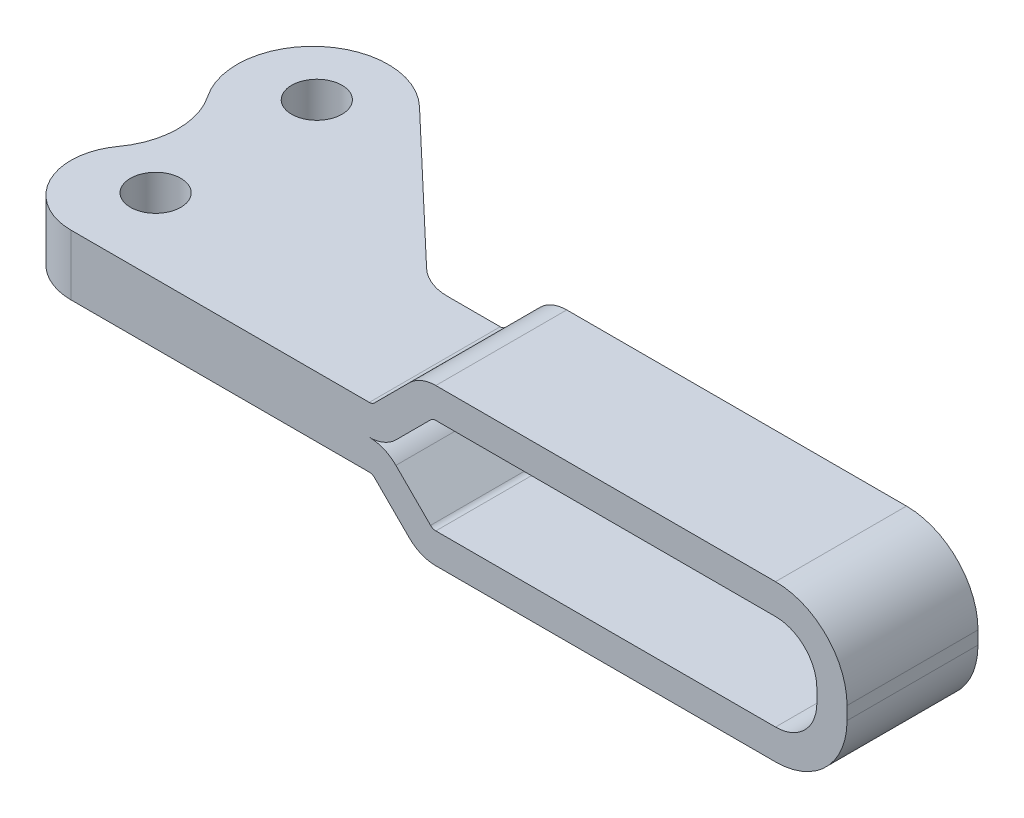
ISO-10303-21;
HEADER;
FILE_DESCRIPTION(('STEP AP214'),'2;1');
FILE_NAME('part.step','',(''),(''),'','','');
FILE_SCHEMA(('AUTOMOTIVE_DESIGN { 1 0 10303 214 1 1 1 1 }'));
ENDSEC;
DATA;
#1=APPLICATION_CONTEXT('core data for automotive mechanical design processes');
#2=APPLICATION_PROTOCOL_DEFINITION('international standard','automotive_design',2000,#1);
#3=PRODUCT_CONTEXT('',#1,'mechanical');
#4=PRODUCT('Part','Part','',(#3));
#5=PRODUCT_RELATED_PRODUCT_CATEGORY('part','',(#4));
#6=PRODUCT_DEFINITION_FORMATION('','',#4);
#7=PRODUCT_DEFINITION_CONTEXT('part definition',#1,'design');
#8=PRODUCT_DEFINITION('design','',#6,#7);
#9=PRODUCT_DEFINITION_SHAPE('','',#8);
#10=(LENGTH_UNIT() NAMED_UNIT(*) SI_UNIT(.MILLI.,.METRE.));
#11=(NAMED_UNIT(*) PLANE_ANGLE_UNIT() SI_UNIT($,.RADIAN.));
#12=(NAMED_UNIT(*) SI_UNIT($,.STERADIAN.) SOLID_ANGLE_UNIT());
#13=UNCERTAINTY_MEASURE_WITH_UNIT(LENGTH_MEASURE(1.E-05),#10,'distance_accuracy_value','');
#14=(GEOMETRIC_REPRESENTATION_CONTEXT(3) GLOBAL_UNCERTAINTY_ASSIGNED_CONTEXT((#13)) GLOBAL_UNIT_ASSIGNED_CONTEXT((#10,
#11,#12)) REPRESENTATION_CONTEXT('',''));
#15=CARTESIAN_POINT('',(0.,0.,0.));
#16=DIRECTION('',(0.,0.,1.));
#17=DIRECTION('',(1.,0.,0.));
#18=AXIS2_PLACEMENT_3D('',#15,#16,#17);
#19=CARTESIAN_POINT('',(76.0517702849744,79.6732669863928,-15.09));
#20=DIRECTION('',(-1.,0.,0.));
#21=DIRECTION('',(0.,-1.,0.));
#22=AXIS2_PLACEMENT_3D('',#19,#20,#21);
#23=PLANE('',#22);
#24=DIRECTION('',(0.,-1.,0.));
#25=VECTOR('',#24,1.);
#26=CARTESIAN_POINT('',(76.0517702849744,79.6732669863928,7.41));
#27=LINE('',#26,#25);
#28=CARTESIAN_POINT('',(76.0517702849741,-0.650000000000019,7.41));
#29=VERTEX_POINT('',#28);
#30=CARTESIAN_POINT('',(76.0517702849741,0.649999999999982,7.41));
#31=VERTEX_POINT('',#30);
#32=EDGE_CURVE('E215',#29,#31,#27,.F.);
#33=ORIENTED_EDGE('',*,*,#32,.F.);
#34=DIRECTION('',(0.,0.,-1.));
#35=VECTOR('',#34,1.);
#36=CARTESIAN_POINT('',(76.0517702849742,-0.650000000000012,16.8905412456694));
#37=LINE('',#36,#35);
#38=CARTESIAN_POINT('',(76.0517702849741,-0.650000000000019,-5.59));
#39=VERTEX_POINT('',#38);
#40=EDGE_CURVE('E309',#39,#29,#37,.F.);
#41=ORIENTED_EDGE('',*,*,#40,.F.);
#42=DIRECTION('',(0.,-1.,0.));
#43=VECTOR('',#42,1.);
#44=CARTESIAN_POINT('',(76.0517702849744,79.6732669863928,-5.59));
#45=LINE('',#44,#43);
#46=CARTESIAN_POINT('',(76.0517702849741,0.649999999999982,-5.59));
#47=VERTEX_POINT('',#46);
#48=EDGE_CURVE('E322',#47,#39,#45,.T.);
#49=ORIENTED_EDGE('',*,*,#48,.F.);
#50=DIRECTION('',(0.,0.,-1.));
#51=VECTOR('',#50,1.);
#52=CARTESIAN_POINT('',(76.0517702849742,0.649999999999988,16.8905412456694));
#53=LINE('',#52,#51);
#54=EDGE_CURVE('E282',#31,#47,#53,.T.);
#55=ORIENTED_EDGE('',*,*,#54,.F.);
#56=EDGE_LOOP('',(#33,#41,#49,#55));
#57=FACE_BOUND('',#56,.T.);
#58=ADVANCED_FACE('F14',(#57),#23,.F.);
#59=CARTESIAN_POINT('',(35.2245493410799,4.0134,14.3668093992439));
#60=DIRECTION('',(0.,0.,-1.));
#61=DIRECTION('',(-1.,0.,0.));
#62=AXIS2_PLACEMENT_3D('',#59,#60,#61);
#63=CYLINDRICAL_SURFACE('',#62,0.736599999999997);
#64=DIRECTION('',(0.,0.,1.));
#65=VECTOR('',#64,1.);
#66=CARTESIAN_POINT('',(34.7036944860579,4.534254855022,-15.09));
#67=LINE('',#66,#65);
#68=CARTESIAN_POINT('',(34.7036944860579,4.53425485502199,-5.59));
#69=VERTEX_POINT('',#68);
#70=CARTESIAN_POINT('',(34.7036944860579,4.53425485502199,7.41));
#71=VERTEX_POINT('',#70);
#72=EDGE_CURVE('E217',#69,#71,#67,.T.);
#73=ORIENTED_EDGE('',*,*,#72,.F.);
#74=CARTESIAN_POINT('',(35.2245493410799,4.0134,-5.59));
#75=DIRECTION('',(0.,0.,-1.));
#76=DIRECTION('',(-1.,0.,0.));
#77=AXIS2_PLACEMENT_3D('',#74,#75,#76);
#78=CIRCLE('',#77,0.736599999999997);
#79=CARTESIAN_POINT('',(35.2245493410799,4.75,-5.59));
#80=VERTEX_POINT('',#79);
#81=EDGE_CURVE('E17',#80,#69,#78,.F.);
#82=ORIENTED_EDGE('',*,*,#81,.F.);
#83=DIRECTION('',(0.,0.,-1.));
#84=VECTOR('',#83,1.);
#85=CARTESIAN_POINT('',(35.2245493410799,4.75,-15.09));
#86=LINE('',#85,#84);
#87=CARTESIAN_POINT('',(35.2245493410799,4.75,7.41));
#88=VERTEX_POINT('',#87);
#89=EDGE_CURVE('E222',#88,#80,#86,.T.);
#90=ORIENTED_EDGE('',*,*,#89,.F.);
#91=CARTESIAN_POINT('',(35.2245493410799,4.0134,7.41));
#92=DIRECTION('',(0.,0.,-1.));
#93=DIRECTION('',(-1.,0.,0.));
#94=AXIS2_PLACEMENT_3D('',#91,#92,#93);
#95=CIRCLE('',#94,0.736599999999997);
#96=EDGE_CURVE('E214',#71,#88,#95,.T.);
#97=ORIENTED_EDGE('',*,*,#96,.F.);
#98=EDGE_LOOP('',(#73,#82,#90,#97));
#99=FACE_BOUND('',#98,.T.);
#100=ADVANCED_FACE('F218',(#99),#63,.F.);
#101=CARTESIAN_POINT('',(35.2245493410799,-4.0134,14.7528843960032));
#102=DIRECTION('',(0.,0.,-1.));
#103=DIRECTION('',(-1.,0.,0.));
#104=AXIS2_PLACEMENT_3D('',#101,#102,#103);
#105=CYLINDRICAL_SURFACE('',#104,0.736599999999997);
#106=DIRECTION('',(0.,0.,-1.));
#107=VECTOR('',#106,1.);
#108=CARTESIAN_POINT('',(35.2245493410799,-4.75,-15.09));
#109=LINE('',#108,#107);
#110=CARTESIAN_POINT('',(35.2245493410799,-4.75,7.41));
#111=VERTEX_POINT('',#110);
#112=CARTESIAN_POINT('',(35.2245493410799,-4.75,-5.59));
#113=VERTEX_POINT('',#112);
#114=EDGE_CURVE('E258',#111,#113,#109,.T.);
#115=ORIENTED_EDGE('',*,*,#114,.T.);
#116=CARTESIAN_POINT('',(35.2245493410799,-4.0134,-5.59));
#117=DIRECTION('',(0.,0.,-1.));
#118=DIRECTION('',(-1.,0.,0.));
#119=AXIS2_PLACEMENT_3D('',#116,#117,#118);
#120=CIRCLE('',#119,0.736599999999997);
#121=CARTESIAN_POINT('',(34.7036944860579,-4.534254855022,-5.59));
#122=VERTEX_POINT('',#121);
#123=EDGE_CURVE('E408',#122,#113,#120,.F.);
#124=ORIENTED_EDGE('',*,*,#123,.F.);
#125=DIRECTION('',(0.,0.,1.));
#126=VECTOR('',#125,1.);
#127=CARTESIAN_POINT('',(34.7036944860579,-4.53425485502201,-15.09));
#128=LINE('',#127,#126);
#129=CARTESIAN_POINT('',(34.7036944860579,-4.53425485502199,7.41));
#130=VERTEX_POINT('',#129);
#131=EDGE_CURVE('E265',#122,#130,#128,.T.);
#132=ORIENTED_EDGE('',*,*,#131,.T.);
#133=CARTESIAN_POINT('',(35.2245493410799,-4.0134,7.41));
#134=DIRECTION('',(0.,0.,-1.));
#135=DIRECTION('',(-1.,0.,0.));
#136=AXIS2_PLACEMENT_3D('',#133,#134,#135);
#137=CIRCLE('',#136,0.736599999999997);
#138=EDGE_CURVE('E318',#111,#130,#137,.T.);
#139=ORIENTED_EDGE('',*,*,#138,.F.);
#140=EDGE_LOOP('',(#115,#124,#132,#139));
#141=FACE_BOUND('',#140,.T.);
#142=ADVANCED_FACE('F510',(#141),#105,.F.);
#143=CARTESIAN_POINT('',(73.0517702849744,79.6732669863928,-15.09));
#144=DIRECTION('',(-1.,0.,0.));
#145=DIRECTION('',(0.,-1.,0.));
#146=AXIS2_PLACEMENT_3D('',#143,#144,#145);
#147=PLANE('',#146);
#148=DIRECTION('',(0.,-1.,0.));
#149=VECTOR('',#148,1.);
#150=CARTESIAN_POINT('',(73.0517702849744,79.6732669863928,7.41));
#151=LINE('',#150,#149);
#152=CARTESIAN_POINT('',(73.0517702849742,-0.650000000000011,7.41));
#153=VERTEX_POINT('',#152);
#154=CARTESIAN_POINT('',(73.0517702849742,0.64999999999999,7.41));
#155=VERTEX_POINT('',#154);
#156=EDGE_CURVE('E317',#153,#155,#151,.F.);
#157=ORIENTED_EDGE('',*,*,#156,.T.);
#158=DIRECTION('',(0.,0.,-1.));
#159=VECTOR('',#158,1.);
#160=CARTESIAN_POINT('',(73.0517702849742,0.649999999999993,16.8905412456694));
#161=LINE('',#160,#159);
#162=CARTESIAN_POINT('',(73.0517702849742,0.64999999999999,-5.59));
#163=VERTEX_POINT('',#162);
#164=EDGE_CURVE('E275',#155,#163,#161,.T.);
#165=ORIENTED_EDGE('',*,*,#164,.T.);
#166=DIRECTION('',(0.,-1.,0.));
#167=VECTOR('',#166,1.);
#168=CARTESIAN_POINT('',(73.0517702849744,79.6732669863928,-5.59));
#169=LINE('',#168,#167);
#170=CARTESIAN_POINT('',(73.0517702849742,-0.650000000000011,-5.59));
#171=VERTEX_POINT('',#170);
#172=EDGE_CURVE('E315',#163,#171,#169,.T.);
#173=ORIENTED_EDGE('',*,*,#172,.T.);
#174=DIRECTION('',(0.,0.,-1.));
#175=VECTOR('',#174,1.);
#176=CARTESIAN_POINT('',(73.0517702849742,-0.650000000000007,16.8905412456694));
#177=LINE('',#176,#175);
#178=EDGE_CURVE('E254',#171,#153,#177,.F.);
#179=ORIENTED_EDGE('',*,*,#178,.T.);
#180=EDGE_LOOP('',(#157,#165,#173,#179));
#181=FACE_BOUND('',#180,.T.);
#182=ADVANCED_FACE('F769',(#181),#147,.T.);
#183=CARTESIAN_POINT('',(28.6216892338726,3.7366,14.3668093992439));
#184=DIRECTION('',(0.,0.,-1.));
#185=DIRECTION('',(-1.,0.,0.));
#186=AXIS2_PLACEMENT_3D('',#183,#184,#185);
#187=CYLINDRICAL_SURFACE('',#186,0.7366);
#188=DIRECTION('',(0.,0.,1.));
#189=VECTOR('',#188,1.);
#190=CARTESIAN_POINT('',(29.1425440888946,3.21574514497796,-15.09));
#191=LINE('',#190,#189);
#192=CARTESIAN_POINT('',(29.1425440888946,3.21574514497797,7.41));
#193=VERTEX_POINT('',#192);
#194=CARTESIAN_POINT('',(29.1425440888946,3.21574514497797,-5.59));
#195=VERTEX_POINT('',#194);
#196=EDGE_CURVE('E290',#193,#195,#191,.F.);
#197=ORIENTED_EDGE('',*,*,#196,.T.);
#198=CARTESIAN_POINT('',(28.6216892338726,3.7366,-5.59));
#199=DIRECTION('',(0.,0.,-1.));
#200=DIRECTION('',(-1.,0.,0.));
#201=AXIS2_PLACEMENT_3D('',#198,#199,#200);
#202=CIRCLE('',#201,0.7366);
#203=CARTESIAN_POINT('',(28.6216892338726,3.,-5.59));
#204=VERTEX_POINT('',#203);
#205=EDGE_CURVE('E320',#204,#195,#202,.F.);
#206=ORIENTED_EDGE('',*,*,#205,.F.);
#207=DIRECTION('',(0.,0.,-1.));
#208=VECTOR('',#207,1.);
#209=CARTESIAN_POINT('',(28.6216892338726,3.,-15.09));
#210=LINE('',#209,#208);
#211=CARTESIAN_POINT('',(28.6216892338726,3.,7.41));
#212=VERTEX_POINT('',#211);
#213=EDGE_CURVE('E260',#204,#212,#210,.F.);
#214=ORIENTED_EDGE('',*,*,#213,.T.);
#215=CARTESIAN_POINT('',(28.6216892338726,3.7366,7.41));
#216=DIRECTION('',(0.,0.,-1.));
#217=DIRECTION('',(-1.,0.,0.));
#218=AXIS2_PLACEMENT_3D('',#215,#216,#217);
#219=CIRCLE('',#218,0.7366);
#220=EDGE_CURVE('E312',#193,#212,#219,.T.);
#221=ORIENTED_EDGE('',*,*,#220,.F.);
#222=EDGE_LOOP('',(#197,#206,#214,#221));
#223=FACE_BOUND('',#222,.T.);
#224=ADVANCED_FACE('F761',(#223),#187,.F.);
#225=CARTESIAN_POINT('',(68.9517702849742,-0.65,16.8905412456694));
#226=DIRECTION('',(0.,0.,-1.));
#227=DIRECTION('',(0.,1.,0.));
#228=AXIS2_PLACEMENT_3D('',#225,#226,#227);
#229=CYLINDRICAL_SURFACE('',#228,7.1);
#230=CARTESIAN_POINT('',(68.9517702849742,-0.65,-5.59));
#231=DIRECTION('',(0.,0.,-1.));
#232=DIRECTION('',(0.,1.,0.));
#233=AXIS2_PLACEMENT_3D('',#230,#231,#232);
#234=CIRCLE('',#233,7.1);
#235=CARTESIAN_POINT('',(68.9517702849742,-7.75,-5.59));
#236=VERTEX_POINT('',#235);
#237=EDGE_CURVE('E300',#236,#39,#234,.F.);
#238=ORIENTED_EDGE('',*,*,#237,.T.);
#239=ORIENTED_EDGE('',*,*,#40,.T.);
#240=CARTESIAN_POINT('',(68.9517702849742,-0.65,7.41));
#241=DIRECTION('',(0.,0.,-1.));
#242=DIRECTION('',(0.,1.,0.));
#243=AXIS2_PLACEMENT_3D('',#240,#241,#242);
#244=CIRCLE('',#243,7.1);
#245=CARTESIAN_POINT('',(68.9517702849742,-7.75,7.41));
#246=VERTEX_POINT('',#245);
#247=EDGE_CURVE('E374',#29,#246,#244,.T.);
#248=ORIENTED_EDGE('',*,*,#247,.T.);
#249=DIRECTION('',(0.,0.,-1.));
#250=VECTOR('',#249,1.);
#251=CARTESIAN_POINT('',(68.9517702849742,-7.75,-15.09));
#252=LINE('',#251,#250);
#253=EDGE_CURVE('E306',#236,#246,#252,.F.);
#254=ORIENTED_EDGE('',*,*,#253,.F.);
#255=EDGE_LOOP('',(#238,#239,#248,#254));
#256=FACE_BOUND('',#255,.T.);
#257=ADVANCED_FACE('F462',(#256),#229,.T.);
#258=CARTESIAN_POINT('',(-1.2750372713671,-7.75,-15.09));
#259=DIRECTION('',(0.,-1.,0.));
#260=DIRECTION('',(0.,0.,-1.));
#261=AXIS2_PLACEMENT_3D('',#258,#259,#260);
#262=PLANE('',#261);
#263=DIRECTION('',(-1.,0.,0.));
#264=VECTOR('',#263,1.);
#265=CARTESIAN_POINT('',(77.85,-7.75,7.41));
#266=LINE('',#265,#264);
#267=CARTESIAN_POINT('',(35.2245493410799,-7.75,7.41));
#268=VERTEX_POINT('',#267);
#269=EDGE_CURVE('E373',#246,#268,#266,.T.);
#270=ORIENTED_EDGE('',*,*,#269,.T.);
#271=DIRECTION('',(0.,0.,-1.));
#272=VECTOR('',#271,1.);
#273=CARTESIAN_POINT('',(35.2245493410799,-7.75,14.7528843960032));
#274=LINE('',#273,#272);
#275=CARTESIAN_POINT('',(35.2245493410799,-7.75,-5.59));
#276=VERTEX_POINT('',#275);
#277=EDGE_CURVE('E303',#276,#268,#274,.F.);
#278=ORIENTED_EDGE('',*,*,#277,.F.);
#279=DIRECTION('',(1.,0.,0.));
#280=VECTOR('',#279,1.);
#281=CARTESIAN_POINT('',(23.37761963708,-7.75,-5.59));
#282=LINE('',#281,#280);
#283=EDGE_CURVE('E379',#276,#236,#282,.T.);
#284=ORIENTED_EDGE('',*,*,#283,.T.);
#285=ORIENTED_EDGE('',*,*,#253,.T.);
#286=EDGE_LOOP('',(#270,#278,#284,#285));
#287=FACE_BOUND('',#286,.T.);
#288=ADVANCED_FACE('F465',(#287),#262,.T.);
#289=CARTESIAN_POINT('',(35.2245493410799,-4.0134,14.7528843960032));
#290=DIRECTION('',(0.,0.,-1.));
#291=DIRECTION('',(-1.,0.,0.));
#292=AXIS2_PLACEMENT_3D('',#289,#290,#291);
#293=CYLINDRICAL_SURFACE('',#292,3.7366);
#294=CARTESIAN_POINT('',(35.2245493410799,-4.0134,7.41));
#295=DIRECTION('',(0.,0.,-1.));
#296=DIRECTION('',(-1.,0.,0.));
#297=AXIS2_PLACEMENT_3D('',#294,#295,#296);
#298=CIRCLE('',#297,3.7366);
#299=CARTESIAN_POINT('',(32.5823741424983,-6.65557519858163,7.41));
#300=VERTEX_POINT('',#299);
#301=EDGE_CURVE('E371',#268,#300,#298,.T.);
#302=ORIENTED_EDGE('',*,*,#301,.T.);
#303=DIRECTION('',(0.,0.,1.));
#304=VECTOR('',#303,1.);
#305=CARTESIAN_POINT('',(32.5823741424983,-6.65557519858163,-15.09));
#306=LINE('',#305,#304);
#307=CARTESIAN_POINT('',(32.5823741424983,-6.65557519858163,-5.59));
#308=VERTEX_POINT('',#307);
#309=EDGE_CURVE('E293',#308,#300,#306,.T.);
#310=ORIENTED_EDGE('',*,*,#309,.F.);
#311=CARTESIAN_POINT('',(35.2245493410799,-4.0134,-5.59));
#312=DIRECTION('',(0.,0.,-1.));
#313=DIRECTION('',(-1.,0.,0.));
#314=AXIS2_PLACEMENT_3D('',#311,#312,#313);
#315=CIRCLE('',#314,3.7366);
#316=EDGE_CURVE('E380',#308,#276,#315,.F.);
#317=ORIENTED_EDGE('',*,*,#316,.T.);
#318=ORIENTED_EDGE('',*,*,#277,.T.);
#319=EDGE_LOOP('',(#302,#310,#317,#318));
#320=FACE_BOUND('',#319,.T.);
#321=ADVANCED_FACE('F470',(#320),#293,.T.);
#322=CARTESIAN_POINT('',(8.015387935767,17.9114110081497,-15.09));
#323=DIRECTION('',(-0.707106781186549,-0.707106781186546,0.));
#324=DIRECTION('',(0.707106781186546,-0.707106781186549,0.));
#325=AXIS2_PLACEMENT_3D('',#322,#323,#324);
#326=PLANE('',#325);
#327=DIRECTION('',(0.,0.,-1.));
#328=VECTOR('',#327,1.);
#329=CARTESIAN_POINT('',(29.1425440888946,-3.21574514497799,14.3668093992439));
#330=LINE('',#329,#328);
#331=CARTESIAN_POINT('',(29.1425440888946,-3.21574514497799,7.41));
#332=VERTEX_POINT('',#331);
#333=CARTESIAN_POINT('',(29.1425440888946,-3.21574514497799,-5.59));
#334=VERTEX_POINT('',#333);
#335=EDGE_CURVE('E297',#332,#334,#330,.T.);
#336=ORIENTED_EDGE('',*,*,#335,.T.);
#337=DIRECTION('',(0.707106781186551,-0.707106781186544,0.));
#338=VECTOR('',#337,1.);
#339=CARTESIAN_POINT('',(29.1425440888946,-3.21574514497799,-5.59));
#340=LINE('',#339,#338);
#341=EDGE_CURVE('E244',#334,#308,#340,.T.);
#342=ORIENTED_EDGE('',*,*,#341,.T.);
#343=ORIENTED_EDGE('',*,*,#309,.T.);
#344=DIRECTION('',(-0.707106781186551,0.707106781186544,0.));
#345=VECTOR('',#344,1.);
#346=CARTESIAN_POINT('',(32.5823741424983,-6.65557519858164,7.41));
#347=LINE('',#346,#345);
#348=EDGE_CURVE('E370',#300,#332,#347,.T.);
#349=ORIENTED_EDGE('',*,*,#348,.T.);
#350=EDGE_LOOP('',(#336,#342,#343,#349));
#351=FACE_BOUND('',#350,.T.);
#352=ADVANCED_FACE('F474',(#351),#326,.T.);
#353=CARTESIAN_POINT('',(8.015387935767,-17.9114110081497,-15.09));
#354=DIRECTION('',(0.707106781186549,-0.707106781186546,0.));
#355=DIRECTION('',(0.707106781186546,0.707106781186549,0.));
#356=AXIS2_PLACEMENT_3D('',#353,#354,#355);
#357=PLANE('',#356);
#358=ORIENTED_EDGE('',*,*,#196,.F.);
#359=DIRECTION('',(0.707106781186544,0.70710678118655,0.));
#360=VECTOR('',#359,1.);
#361=CARTESIAN_POINT('',(29.1425440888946,3.21574514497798,7.41));
#362=LINE('',#361,#360);
#363=CARTESIAN_POINT('',(32.5823741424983,6.65557519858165,7.41));
#364=VERTEX_POINT('',#363);
#365=EDGE_CURVE('E366',#193,#364,#362,.T.);
#366=ORIENTED_EDGE('',*,*,#365,.T.);
#367=DIRECTION('',(0.,0.,-1.));
#368=VECTOR('',#367,1.);
#369=CARTESIAN_POINT('',(32.5823741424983,6.65557519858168,14.3668093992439));
#370=LINE('',#369,#368);
#371=CARTESIAN_POINT('',(32.5823741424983,6.65557519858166,-5.59));
#372=VERTEX_POINT('',#371);
#373=EDGE_CURVE('E287',#372,#364,#370,.F.);
#374=ORIENTED_EDGE('',*,*,#373,.F.);
#375=DIRECTION('',(-0.707106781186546,-0.707106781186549,0.));
#376=VECTOR('',#375,1.);
#377=CARTESIAN_POINT('',(32.5823741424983,6.65557519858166,-5.59));
#378=LINE('',#377,#376);
#379=EDGE_CURVE('E386',#372,#195,#378,.T.);
#380=ORIENTED_EDGE('',*,*,#379,.T.);
#381=EDGE_LOOP('',(#358,#366,#374,#380));
#382=FACE_BOUND('',#381,.T.);
#383=ADVANCED_FACE('F724',(#382),#357,.F.);
#384=CARTESIAN_POINT('',(35.2245493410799,4.0134,14.3668093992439));
#385=DIRECTION('',(0.,0.,-1.));
#386=DIRECTION('',(-1.,0.,0.));
#387=AXIS2_PLACEMENT_3D('',#384,#385,#386);
#388=CYLINDRICAL_SURFACE('',#387,3.7366);
#389=CARTESIAN_POINT('',(35.2245493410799,4.0134,7.41));
#390=DIRECTION('',(0.,0.,-1.));
#391=DIRECTION('',(-1.,0.,0.));
#392=AXIS2_PLACEMENT_3D('',#389,#390,#391);
#393=CIRCLE('',#392,3.7366);
#394=CARTESIAN_POINT('',(35.2245493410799,7.75,7.41));
#395=VERTEX_POINT('',#394);
#396=EDGE_CURVE('E364',#364,#395,#393,.T.);
#397=ORIENTED_EDGE('',*,*,#396,.T.);
#398=DIRECTION('',(0.,0.,-1.));
#399=VECTOR('',#398,1.);
#400=CARTESIAN_POINT('',(35.2245493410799,7.75,-15.09));
#401=LINE('',#400,#399);
#402=CARTESIAN_POINT('',(35.2245493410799,7.75,-5.59));
#403=VERTEX_POINT('',#402);
#404=EDGE_CURVE('E285',#395,#403,#401,.T.);
#405=ORIENTED_EDGE('',*,*,#404,.T.);
#406=CARTESIAN_POINT('',(35.2245493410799,4.0134,-5.59));
#407=DIRECTION('',(0.,0.,-1.));
#408=DIRECTION('',(-1.,0.,0.));
#409=AXIS2_PLACEMENT_3D('',#406,#407,#408);
#410=CIRCLE('',#409,3.7366);
#411=EDGE_CURVE('E383',#403,#372,#410,.F.);
#412=ORIENTED_EDGE('',*,*,#411,.T.);
#413=ORIENTED_EDGE('',*,*,#373,.T.);
#414=EDGE_LOOP('',(#397,#405,#412,#413));
#415=FACE_BOUND('',#414,.T.);
#416=ADVANCED_FACE('F450',(#415),#388,.T.);
#417=CARTESIAN_POINT('',(-1.2750372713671,7.75,-15.09));
#418=DIRECTION('',(0.,-1.,0.));
#419=DIRECTION('',(0.,0.,-1.));
#420=AXIS2_PLACEMENT_3D('',#417,#418,#419);
#421=PLANE('',#420);
#422=DIRECTION('',(-1.,0.,0.));
#423=VECTOR('',#422,1.);
#424=CARTESIAN_POINT('',(77.85,7.75,7.41));
#425=LINE('',#424,#423);
#426=CARTESIAN_POINT('',(68.9517702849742,7.75,7.41));
#427=VERTEX_POINT('',#426);
#428=EDGE_CURVE('E363',#395,#427,#425,.F.);
#429=ORIENTED_EDGE('',*,*,#428,.T.);
#430=DIRECTION('',(0.,0.,-1.));
#431=VECTOR('',#430,1.);
#432=CARTESIAN_POINT('',(68.9517702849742,7.75,16.8905412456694));
#433=LINE('',#432,#431);
#434=CARTESIAN_POINT('',(68.9517702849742,7.75,-5.59));
#435=VERTEX_POINT('',#434);
#436=EDGE_CURVE('E279',#435,#427,#433,.F.);
#437=ORIENTED_EDGE('',*,*,#436,.F.);
#438=DIRECTION('',(1.,0.,0.));
#439=VECTOR('',#438,1.);
#440=CARTESIAN_POINT('',(23.37761963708,7.75,-5.59));
#441=LINE('',#440,#439);
#442=EDGE_CURVE('E387',#435,#403,#441,.F.);
#443=ORIENTED_EDGE('',*,*,#442,.T.);
#444=ORIENTED_EDGE('',*,*,#404,.F.);
#445=EDGE_LOOP('',(#429,#437,#443,#444));
#446=FACE_BOUND('',#445,.T.);
#447=ADVANCED_FACE('F443',(#446),#421,.F.);
#448=CARTESIAN_POINT('',(68.9517702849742,0.65,16.8905412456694));
#449=DIRECTION('',(0.,0.,-1.));
#450=DIRECTION('',(0.,1.,0.));
#451=AXIS2_PLACEMENT_3D('',#448,#449,#450);
#452=CYLINDRICAL_SURFACE('',#451,7.1);
#453=CARTESIAN_POINT('',(68.9517702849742,0.65,-5.59));
#454=DIRECTION('',(0.,0.,-1.));
#455=DIRECTION('',(0.,1.,0.));
#456=AXIS2_PLACEMENT_3D('',#453,#454,#455);
#457=CIRCLE('',#456,7.1);
#458=EDGE_CURVE('E388',#47,#435,#457,.F.);
#459=ORIENTED_EDGE('',*,*,#458,.T.);
#460=ORIENTED_EDGE('',*,*,#436,.T.);
#461=CARTESIAN_POINT('',(68.9517702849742,0.65,7.41));
#462=DIRECTION('',(0.,0.,-1.));
#463=DIRECTION('',(0.,1.,0.));
#464=AXIS2_PLACEMENT_3D('',#461,#462,#463);
#465=CIRCLE('',#464,7.1);
#466=EDGE_CURVE('E360',#427,#31,#465,.T.);
#467=ORIENTED_EDGE('',*,*,#466,.T.);
#468=ORIENTED_EDGE('',*,*,#54,.T.);
#469=EDGE_LOOP('',(#459,#460,#467,#468));
#470=FACE_BOUND('',#469,.T.);
#471=ADVANCED_FACE('F455',(#470),#452,.T.);
#472=CARTESIAN_POINT('',(68.9517702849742,0.65,16.8905412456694));
#473=DIRECTION('',(0.,0.,-1.));
#474=DIRECTION('',(0.,1.,0.));
#475=AXIS2_PLACEMENT_3D('',#472,#473,#474);
#476=CYLINDRICAL_SURFACE('',#475,4.1);
#477=ORIENTED_EDGE('',*,*,#164,.F.);
#478=CARTESIAN_POINT('',(68.9517702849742,0.65,7.41));
#479=DIRECTION('',(0.,0.,-1.));
#480=DIRECTION('',(0.,1.,0.));
#481=AXIS2_PLACEMENT_3D('',#478,#479,#480);
#482=CIRCLE('',#481,4.1);
#483=CARTESIAN_POINT('',(68.9517702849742,4.75,7.41));
#484=VERTEX_POINT('',#483);
#485=EDGE_CURVE('E357',#155,#484,#482,.F.);
#486=ORIENTED_EDGE('',*,*,#485,.T.);
#487=DIRECTION('',(0.,0.,-1.));
#488=VECTOR('',#487,1.);
#489=CARTESIAN_POINT('',(68.9517702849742,4.75,-15.09));
#490=LINE('',#489,#488);
#491=CARTESIAN_POINT('',(68.9517702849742,4.75,-5.59));
#492=VERTEX_POINT('',#491);
#493=EDGE_CURVE('E272',#492,#484,#490,.F.);
#494=ORIENTED_EDGE('',*,*,#493,.F.);
#495=CARTESIAN_POINT('',(68.9517702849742,0.65,-5.59));
#496=DIRECTION('',(0.,0.,-1.));
#497=DIRECTION('',(0.,1.,0.));
#498=AXIS2_PLACEMENT_3D('',#495,#496,#497);
#499=CIRCLE('',#498,4.1);
#500=EDGE_CURVE('E229',#492,#163,#499,.T.);
#501=ORIENTED_EDGE('',*,*,#500,.T.);
#502=EDGE_LOOP('',(#477,#486,#494,#501));
#503=FACE_BOUND('',#502,.T.);
#504=ADVANCED_FACE('F694',(#503),#476,.F.);
#505=CARTESIAN_POINT('',(-1.2750372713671,4.75,-15.09));
#506=DIRECTION('',(0.,-1.,0.));
#507=DIRECTION('',(0.,0.,-1.));
#508=AXIS2_PLACEMENT_3D('',#505,#506,#507);
#509=PLANE('',#508);
#510=DIRECTION('',(-1.,0.,0.));
#511=VECTOR('',#510,1.);
#512=CARTESIAN_POINT('',(77.85,4.75,7.41));
#513=LINE('',#512,#511);
#514=EDGE_CURVE('E359',#484,#88,#513,.T.);
#515=ORIENTED_EDGE('',*,*,#514,.T.);
#516=ORIENTED_EDGE('',*,*,#89,.T.);
#517=DIRECTION('',(1.,0.,0.));
#518=VECTOR('',#517,1.);
#519=CARTESIAN_POINT('',(23.37761963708,4.75,-5.59));
#520=LINE('',#519,#518);
#521=EDGE_CURVE('E213',#80,#492,#520,.T.);
#522=ORIENTED_EDGE('',*,*,#521,.T.);
#523=ORIENTED_EDGE('',*,*,#493,.T.);
#524=EDGE_LOOP('',(#515,#516,#522,#523));
#525=FACE_BOUND('',#524,.T.);
#526=ADVANCED_FACE('F418',(#525),#509,.T.);
#527=CARTESIAN_POINT('',(10.1367082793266,-20.0327313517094,-15.09));
#528=DIRECTION('',(0.707106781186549,-0.707106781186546,0.));
#529=DIRECTION('',(0.707106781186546,0.707106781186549,0.));
#530=AXIS2_PLACEMENT_3D('',#527,#528,#529);
#531=PLANE('',#530);
#532=DIRECTION('',(0.,0.,-1.));
#533=VECTOR('',#532,1.);
#534=CARTESIAN_POINT('',(31.2638644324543,1.09442480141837,14.3668093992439));
#535=LINE('',#534,#533);
#536=CARTESIAN_POINT('',(31.2638644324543,1.09442480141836,-5.59));
#537=VERTEX_POINT('',#536);
#538=CARTESIAN_POINT('',(31.2638644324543,1.09442480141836,7.41));
#539=VERTEX_POINT('',#538);
#540=EDGE_CURVE('E221',#537,#539,#535,.F.);
#541=ORIENTED_EDGE('',*,*,#540,.F.);
#542=DIRECTION('',(0.707106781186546,0.70710678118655,0.));
#543=VECTOR('',#542,1.);
#544=CARTESIAN_POINT('',(31.2638644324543,1.09442480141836,-5.59));
#545=LINE('',#544,#543);
#546=EDGE_CURVE('E211',#537,#69,#545,.T.);
#547=ORIENTED_EDGE('',*,*,#546,.T.);
#548=ORIENTED_EDGE('',*,*,#72,.T.);
#549=DIRECTION('',(-0.707106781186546,-0.707106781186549,0.));
#550=VECTOR('',#549,1.);
#551=CARTESIAN_POINT('',(34.7036944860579,4.534254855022,7.41));
#552=LINE('',#551,#550);
#553=EDGE_CURVE('E356',#71,#539,#552,.T.);
#554=ORIENTED_EDGE('',*,*,#553,.T.);
#555=EDGE_LOOP('',(#541,#547,#548,#554));
#556=FACE_BOUND('',#555,.T.);
#557=ADVANCED_FACE('F224',(#556),#531,.T.);
#558=CARTESIAN_POINT('',(28.6216892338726,3.7366,14.3668093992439));
#559=DIRECTION('',(0.,0.,-1.));
#560=DIRECTION('',(-1.,0.,0.));
#561=AXIS2_PLACEMENT_3D('',#558,#559,#560);
#562=CYLINDRICAL_SURFACE('',#561,3.7366);
#563=CARTESIAN_POINT('',(28.6216892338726,3.7366,7.41));
#564=DIRECTION('',(0.,0.,-1.));
#565=DIRECTION('',(-1.,0.,0.));
#566=AXIS2_PLACEMENT_3D('',#563,#564,#565);
#567=CIRCLE('',#566,3.7366);
#568=CARTESIAN_POINT('',(28.6216892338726,0.,7.41));
#569=VERTEX_POINT('',#568);
#570=EDGE_CURVE('E354',#539,#569,#567,.T.);
#571=ORIENTED_EDGE('',*,*,#570,.T.);
#572=DIRECTION('',(0.,0.,-1.));
#573=VECTOR('',#572,1.);
#574=CARTESIAN_POINT('',(28.6216892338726,0.,14.3668093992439));
#575=LINE('',#574,#573);
#576=CARTESIAN_POINT('',(28.6216892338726,0.,-5.59));
#577=VERTEX_POINT('',#576);
#578=EDGE_CURVE('E268',#577,#569,#575,.F.);
#579=ORIENTED_EDGE('',*,*,#578,.F.);
#580=CARTESIAN_POINT('',(28.6216892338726,3.7366,-5.59));
#581=DIRECTION('',(0.,0.,-1.));
#582=DIRECTION('',(-1.,0.,0.));
#583=AXIS2_PLACEMENT_3D('',#580,#581,#582);
#584=CIRCLE('',#583,3.7366);
#585=EDGE_CURVE('E227',#577,#537,#584,.F.);
#586=ORIENTED_EDGE('',*,*,#585,.T.);
#587=ORIENTED_EDGE('',*,*,#540,.T.);
#588=EDGE_LOOP('',(#571,#579,#586,#587));
#589=FACE_BOUND('',#588,.T.);
#590=ADVANCED_FACE('F517',(#589),#562,.T.);
#591=CARTESIAN_POINT('',(28.6216892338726,-3.7366,14.3668093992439));
#592=DIRECTION('',(0.,0.,-1.));
#593=DIRECTION('',(-1.,0.,0.));
#594=AXIS2_PLACEMENT_3D('',#591,#592,#593);
#595=CYLINDRICAL_SURFACE('',#594,3.7366);
#596=CARTESIAN_POINT('',(28.6216892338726,-3.7366,7.41));
#597=DIRECTION('',(0.,0.,-1.));
#598=DIRECTION('',(-1.,0.,0.));
#599=AXIS2_PLACEMENT_3D('',#596,#597,#598);
#600=CIRCLE('',#599,3.7366);
#601=CARTESIAN_POINT('',(31.2638644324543,-1.09442480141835,7.41));
#602=VERTEX_POINT('',#601);
#603=EDGE_CURVE('E351',#569,#602,#600,.T.);
#604=ORIENTED_EDGE('',*,*,#603,.T.);
#605=DIRECTION('',(0.,0.,1.));
#606=VECTOR('',#605,1.);
#607=CARTESIAN_POINT('',(31.2638644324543,-1.09442480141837,-15.09));
#608=LINE('',#607,#606);
#609=CARTESIAN_POINT('',(31.2638644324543,-1.09442480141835,-5.59));
#610=VERTEX_POINT('',#609);
#611=EDGE_CURVE('E263',#602,#610,#608,.F.);
#612=ORIENTED_EDGE('',*,*,#611,.T.);
#613=CARTESIAN_POINT('',(28.6216892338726,-3.7366,-5.59));
#614=DIRECTION('',(0.,0.,-1.));
#615=DIRECTION('',(-1.,0.,0.));
#616=AXIS2_PLACEMENT_3D('',#613,#614,#615);
#617=CIRCLE('',#616,3.7366);
#618=EDGE_CURVE('E231',#610,#577,#617,.F.);
#619=ORIENTED_EDGE('',*,*,#618,.T.);
#620=ORIENTED_EDGE('',*,*,#578,.T.);
#621=EDGE_LOOP('',(#604,#612,#619,#620));
#622=FACE_BOUND('',#621,.T.);
#623=ADVANCED_FACE('F515',(#622),#595,.T.);
#624=CARTESIAN_POINT('',(10.1367082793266,20.0327313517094,-15.09));
#625=DIRECTION('',(-0.707106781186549,-0.707106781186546,0.));
#626=DIRECTION('',(0.707106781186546,-0.707106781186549,0.));
#627=AXIS2_PLACEMENT_3D('',#624,#625,#626);
#628=PLANE('',#627);
#629=ORIENTED_EDGE('',*,*,#611,.F.);
#630=DIRECTION('',(0.707106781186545,-0.70710678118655,0.));
#631=VECTOR('',#630,1.);
#632=CARTESIAN_POINT('',(31.2638644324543,-1.09442480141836,7.41));
#633=LINE('',#632,#631);
#634=EDGE_CURVE('E353',#602,#130,#633,.T.);
#635=ORIENTED_EDGE('',*,*,#634,.T.);
#636=ORIENTED_EDGE('',*,*,#131,.F.);
#637=DIRECTION('',(-0.707106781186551,0.707106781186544,0.));
#638=VECTOR('',#637,1.);
#639=CARTESIAN_POINT('',(34.7036944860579,-4.534254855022,-5.59));
#640=LINE('',#639,#638);
#641=EDGE_CURVE('E235',#122,#610,#640,.T.);
#642=ORIENTED_EDGE('',*,*,#641,.T.);
#643=EDGE_LOOP('',(#629,#635,#636,#642));
#644=FACE_BOUND('',#643,.T.);
#645=ADVANCED_FACE('F504',(#644),#628,.F.);
#646=CARTESIAN_POINT('',(-1.2750372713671,-4.75,-15.09));
#647=DIRECTION('',(0.,-1.,0.));
#648=DIRECTION('',(0.,0.,-1.));
#649=AXIS2_PLACEMENT_3D('',#646,#647,#648);
#650=PLANE('',#649);
#651=DIRECTION('',(-1.,0.,0.));
#652=VECTOR('',#651,1.);
#653=CARTESIAN_POINT('',(77.85,-4.75,7.41));
#654=LINE('',#653,#652);
#655=CARTESIAN_POINT('',(68.9517702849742,-4.75,7.41));
#656=VERTEX_POINT('',#655);
#657=EDGE_CURVE('E350',#111,#656,#654,.F.);
#658=ORIENTED_EDGE('',*,*,#657,.T.);
#659=DIRECTION('',(0.,0.,-1.));
#660=VECTOR('',#659,1.);
#661=CARTESIAN_POINT('',(68.9517702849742,-4.75,16.8905412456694));
#662=LINE('',#661,#660);
#663=CARTESIAN_POINT('',(68.9517702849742,-4.75,-5.59));
#664=VERTEX_POINT('',#663);
#665=EDGE_CURVE('E257',#656,#664,#662,.T.);
#666=ORIENTED_EDGE('',*,*,#665,.T.);
#667=DIRECTION('',(1.,0.,0.));
#668=VECTOR('',#667,1.);
#669=CARTESIAN_POINT('',(23.37761963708,-4.75,-5.59));
#670=LINE('',#669,#668);
#671=EDGE_CURVE('E238',#664,#113,#670,.F.);
#672=ORIENTED_EDGE('',*,*,#671,.T.);
#673=ORIENTED_EDGE('',*,*,#114,.F.);
#674=EDGE_LOOP('',(#658,#666,#672,#673));
#675=FACE_BOUND('',#674,.T.);
#676=ADVANCED_FACE('F572',(#675),#650,.F.);
#677=CARTESIAN_POINT('',(68.9517702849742,-0.65,16.8905412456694));
#678=DIRECTION('',(0.,0.,-1.));
#679=DIRECTION('',(0.,1.,0.));
#680=AXIS2_PLACEMENT_3D('',#677,#678,#679);
#681=CYLINDRICAL_SURFACE('',#680,4.1);
#682=ORIENTED_EDGE('',*,*,#665,.F.);
#683=CARTESIAN_POINT('',(68.9517702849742,-0.65,7.41));
#684=DIRECTION('',(0.,0.,-1.));
#685=DIRECTION('',(0.,1.,0.));
#686=AXIS2_PLACEMENT_3D('',#683,#684,#685);
#687=CIRCLE('',#686,4.1);
#688=EDGE_CURVE('E347',#656,#153,#687,.F.);
#689=ORIENTED_EDGE('',*,*,#688,.T.);
#690=ORIENTED_EDGE('',*,*,#178,.F.);
#691=CARTESIAN_POINT('',(68.9517702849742,-0.65,-5.59));
#692=DIRECTION('',(0.,0.,-1.));
#693=DIRECTION('',(0.,1.,0.));
#694=AXIS2_PLACEMENT_3D('',#691,#692,#693);
#695=CIRCLE('',#694,4.1);
#696=EDGE_CURVE('E241',#171,#664,#695,.T.);
#697=ORIENTED_EDGE('',*,*,#696,.T.);
#698=EDGE_LOOP('',(#682,#689,#690,#697));
#699=FACE_BOUND('',#698,.T.);
#700=ADVANCED_FACE('F568',(#699),#681,.F.);
#701=CARTESIAN_POINT('',(0.5,3.,-15.09));
#702=DIRECTION('',(0.,-1.,0.));
#703=DIRECTION('',(0.,0.,-1.));
#704=AXIS2_PLACEMENT_3D('',#701,#702,#703);
#705=PLANE('',#704);
#706=CARTESIAN_POINT('',(23.37761963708,3.,-10.59));
#707=DIRECTION('',(0.,-1.,0.));
#708=DIRECTION('',(0.,0.,-1.));
#709=AXIS2_PLACEMENT_3D('',#706,#707,#708);
#710=CIRCLE('',#709,5.);
#711=CARTESIAN_POINT('',(23.37761963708,3.,-5.59));
#712=VERTEX_POINT('',#711);
#713=CARTESIAN_POINT('',(19.9328505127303,3.,-6.96597383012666));
#714=VERTEX_POINT('',#713);
#715=EDGE_CURVE('E248',#712,#714,#710,.T.);
#716=ORIENTED_EDGE('',*,*,#715,.T.);
#717=DIRECTION('',(0.724805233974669,0.,0.688953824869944));
#718=VECTOR('',#717,1.);
#719=CARTESIAN_POINT('',(5.6671536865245,3.,-20.5260392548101));
#720=LINE('',#719,#718);
#721=CARTESIAN_POINT('',(5.66715368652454,3.,-20.52603925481));
#722=VERTEX_POINT('',#721);
#723=EDGE_CURVE('E249',#714,#722,#720,.F.);
#724=ORIENTED_EDGE('',*,*,#723,.T.);
#725=CARTESIAN_POINT('',(0.5,3.,-15.09));
#726=DIRECTION('',(0.,-1.,0.));
#727=DIRECTION('',(0.,0.,-1.));
#728=AXIS2_PLACEMENT_3D('',#725,#726,#727);
#729=CIRCLE('',#728,7.5);
#730=CARTESIAN_POINT('',(-5.70490562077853,3.,-10.8770264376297));
#731=VERTEX_POINT('',#730);
#732=EDGE_CURVE('E253',#731,#722,#729,.T.);
#733=ORIENTED_EDGE('',*,*,#732,.F.);
#734=CARTESIAN_POINT('',(-12.,3.,-6.60281699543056));
#735=DIRECTION('',(0.,-1.,0.));
#736=DIRECTION('',(0.,0.,-1.));
#737=AXIS2_PLACEMENT_3D('',#734,#735,#736);
#738=CIRCLE('',#737,7.60901305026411);
#739=CARTESIAN_POINT('',(-5.84972714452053,3.,-2.12272509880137));
#740=VERTEX_POINT('',#739);
#741=EDGE_CURVE('E340',#731,#740,#738,.T.);
#742=ORIENTED_EDGE('',*,*,#741,.T.);
#743=CARTESIAN_POINT('',(-1.,3.,1.41));
#744=DIRECTION('',(0.,-1.,0.));
#745=DIRECTION('',(0.,0.,-1.));
#746=AXIS2_PLACEMENT_3D('',#743,#744,#745);
#747=CIRCLE('',#746,6.);
#748=CARTESIAN_POINT('',(-1.,3.,7.41));
#749=VERTEX_POINT('',#748);
#750=EDGE_CURVE('E344',#749,#740,#747,.T.);
#751=ORIENTED_EDGE('',*,*,#750,.F.);
#752=DIRECTION('',(-1.,0.,0.));
#753=VECTOR('',#752,1.);
#754=CARTESIAN_POINT('',(77.85,3.,7.41));
#755=LINE('',#754,#753);
#756=EDGE_CURVE('E369',#749,#212,#755,.F.);
#757=ORIENTED_EDGE('',*,*,#756,.T.);
#758=ORIENTED_EDGE('',*,*,#213,.F.);
#759=DIRECTION('',(1.,0.,0.));
#760=VECTOR('',#759,1.);
#761=CARTESIAN_POINT('',(23.37761963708,3.,-5.59));
#762=LINE('',#761,#760);
#763=EDGE_CURVE('E245',#204,#712,#762,.F.);
#764=ORIENTED_EDGE('',*,*,#763,.T.);
#765=EDGE_LOOP('',(#716,#724,#733,#742,#751,#757,#758,#764));
#766=FACE_BOUND('',#765,.T.);
#767=CARTESIAN_POINT('',(0.,3.,-16.));
#768=DIRECTION('',(0.,1.,0.));
#769=DIRECTION('',(0.,0.,1.));
#770=AXIS2_PLACEMENT_3D('',#767,#768,#769);
#771=CIRCLE('',#770,2.5);
#772=CARTESIAN_POINT('',(0.,3.,-13.5));
#773=VERTEX_POINT('',#772);
#774=EDGE_CURVE('E400',#773,#773,#771,.F.);
#775=ORIENTED_EDGE('',*,*,#774,.T.);
#776=EDGE_LOOP('',(#775));
#777=FACE_BOUND('',#776,.T.);
#778=CARTESIAN_POINT('',(0.,3.,0.));
#779=DIRECTION('',(0.,1.,0.));
#780=DIRECTION('',(0.,0.,1.));
#781=AXIS2_PLACEMENT_3D('',#778,#779,#780);
#782=CIRCLE('',#781,2.5);
#783=CARTESIAN_POINT('',(0.,3.,2.5));
#784=VERTEX_POINT('',#783);
#785=EDGE_CURVE('E296',#784,#784,#782,.F.);
#786=ORIENTED_EDGE('',*,*,#785,.T.);
#787=EDGE_LOOP('',(#786));
#788=FACE_BOUND('',#787,.T.);
#789=ADVANCED_FACE('F564',(#766,#777,#788),#705,.F.);
#790=CARTESIAN_POINT('',(0.,3.,0.));
#791=DIRECTION('',(0.,1.,0.));
#792=DIRECTION('',(0.,0.,1.));
#793=AXIS2_PLACEMENT_3D('',#790,#791,#792);
#794=CYLINDRICAL_SURFACE('',#793,2.5);
#795=ORIENTED_EDGE('',*,*,#785,.F.);
#796=EDGE_LOOP('',(#795));
#797=FACE_BOUND('',#796,.T.);
#798=CARTESIAN_POINT('',(0.,-3.,0.));
#799=DIRECTION('',(0.,1.,0.));
#800=DIRECTION('',(0.,0.,1.));
#801=AXIS2_PLACEMENT_3D('',#798,#799,#800);
#802=CIRCLE('',#801,2.5);
#803=CARTESIAN_POINT('',(0.,-3.,2.5));
#804=VERTEX_POINT('',#803);
#805=EDGE_CURVE('E337',#804,#804,#802,.T.);
#806=ORIENTED_EDGE('',*,*,#805,.F.);
#807=EDGE_LOOP('',(#806));
#808=FACE_BOUND('',#807,.T.);
#809=ADVANCED_FACE('F560',(#797,#808),#794,.F.);
#810=CARTESIAN_POINT('',(0.,3.,-16.));
#811=DIRECTION('',(0.,1.,0.));
#812=DIRECTION('',(0.,0.,1.));
#813=AXIS2_PLACEMENT_3D('',#810,#811,#812);
#814=CYLINDRICAL_SURFACE('',#813,2.5);
#815=ORIENTED_EDGE('',*,*,#774,.F.);
#816=EDGE_LOOP('',(#815));
#817=FACE_BOUND('',#816,.T.);
#818=CARTESIAN_POINT('',(0.,-3.,-16.));
#819=DIRECTION('',(0.,1.,0.));
#820=DIRECTION('',(0.,0.,1.));
#821=AXIS2_PLACEMENT_3D('',#818,#819,#820);
#822=CIRCLE('',#821,2.5);
#823=CARTESIAN_POINT('',(0.,-3.,-13.5));
#824=VERTEX_POINT('',#823);
#825=EDGE_CURVE('E334',#824,#824,#822,.T.);
#826=ORIENTED_EDGE('',*,*,#825,.F.);
#827=EDGE_LOOP('',(#826));
#828=FACE_BOUND('',#827,.T.);
#829=ADVANCED_FACE('F556',(#817,#828),#814,.F.);
#830=CARTESIAN_POINT('',(0.5,3.,-15.09));
#831=DIRECTION('',(0.,-1.,0.));
#832=DIRECTION('',(0.,0.,-1.));
#833=AXIS2_PLACEMENT_3D('',#830,#831,#832);
#834=CYLINDRICAL_SURFACE('',#833,7.5);
#835=DIRECTION('',(0.,1.,0.));
#836=VECTOR('',#835,1.);
#837=CARTESIAN_POINT('',(5.66715368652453,3.,-20.52603925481));
#838=LINE('',#837,#836);
#839=CARTESIAN_POINT('',(5.66715368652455,-3.,-20.52603925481));
#840=VERTEX_POINT('',#839);
#841=EDGE_CURVE('E250',#722,#840,#838,.F.);
#842=ORIENTED_EDGE('',*,*,#841,.T.);
#843=CARTESIAN_POINT('',(0.5,-3.,-15.09));
#844=DIRECTION('',(0.,-1.,0.));
#845=DIRECTION('',(0.,0.,-1.));
#846=AXIS2_PLACEMENT_3D('',#843,#844,#845);
#847=CIRCLE('',#846,7.5);
#848=CARTESIAN_POINT('',(-5.70490562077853,-3.,-10.8770264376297));
#849=VERTEX_POINT('',#848);
#850=EDGE_CURVE('E332',#849,#840,#847,.T.);
#851=ORIENTED_EDGE('',*,*,#850,.F.);
#852=DIRECTION('',(0.,-1.,0.));
#853=VECTOR('',#852,1.);
#854=CARTESIAN_POINT('',(-5.70490562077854,3.,-10.8770264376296));
#855=LINE('',#854,#853);
#856=EDGE_CURVE('E343',#849,#731,#855,.F.);
#857=ORIENTED_EDGE('',*,*,#856,.T.);
#858=ORIENTED_EDGE('',*,*,#732,.T.);
#859=EDGE_LOOP('',(#842,#851,#857,#858));
#860=FACE_BOUND('',#859,.T.);
#861=ADVANCED_FACE('F552',(#860),#834,.T.);
#862=CARTESIAN_POINT('',(5.6671536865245,3.,-20.5260392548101));
#863=DIRECTION('',(-0.688953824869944,0.,0.724805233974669));
#864=DIRECTION('',(0.724805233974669,0.,0.688953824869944));
#865=AXIS2_PLACEMENT_3D('',#862,#863,#864);
#866=PLANE('',#865);
#867=DIRECTION('',(0.,-1.,0.));
#868=VECTOR('',#867,1.);
#869=CARTESIAN_POINT('',(19.9328505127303,3.,-6.96597383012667));
#870=LINE('',#869,#868);
#871=CARTESIAN_POINT('',(19.9328505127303,-3.,-6.96597383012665));
#872=VERTEX_POINT('',#871);
#873=EDGE_CURVE('E246',#714,#872,#870,.T.);
#874=ORIENTED_EDGE('',*,*,#873,.T.);
#875=DIRECTION('',(0.724805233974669,0.,0.688953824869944));
#876=VECTOR('',#875,1.);
#877=CARTESIAN_POINT('',(5.66715368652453,-3.,-20.52603925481));
#878=LINE('',#877,#876);
#879=EDGE_CURVE('E331',#840,#872,#878,.T.);
#880=ORIENTED_EDGE('',*,*,#879,.F.);
#881=ORIENTED_EDGE('',*,*,#841,.F.);
#882=ORIENTED_EDGE('',*,*,#723,.F.);
#883=EDGE_LOOP('',(#874,#880,#881,#882));
#884=FACE_BOUND('',#883,.T.);
#885=ADVANCED_FACE('F548',(#884),#866,.F.);
#886=CARTESIAN_POINT('',(23.37761963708,3.,-10.59));
#887=DIRECTION('',(0.,-1.,0.));
#888=DIRECTION('',(0.,0.,-1.));
#889=AXIS2_PLACEMENT_3D('',#886,#887,#888);
#890=CYLINDRICAL_SURFACE('',#889,5.);
#891=DIRECTION('',(0.,1.,0.));
#892=VECTOR('',#891,1.);
#893=CARTESIAN_POINT('',(23.37761963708,3.,-5.59));
#894=LINE('',#893,#892);
#895=CARTESIAN_POINT('',(23.37761963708,-3.,-5.59));
#896=VERTEX_POINT('',#895);
#897=EDGE_CURVE('E242',#712,#896,#894,.F.);
#898=ORIENTED_EDGE('',*,*,#897,.T.);
#899=CARTESIAN_POINT('',(23.37761963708,-3.,-10.59));
#900=DIRECTION('',(0.,-1.,0.));
#901=DIRECTION('',(0.,0.,-1.));
#902=AXIS2_PLACEMENT_3D('',#899,#900,#901);
#903=CIRCLE('',#902,5.);
#904=EDGE_CURVE('E327',#872,#896,#903,.F.);
#905=ORIENTED_EDGE('',*,*,#904,.F.);
#906=ORIENTED_EDGE('',*,*,#873,.F.);
#907=ORIENTED_EDGE('',*,*,#715,.F.);
#908=EDGE_LOOP('',(#898,#905,#906,#907));
#909=FACE_BOUND('',#908,.T.);
#910=ADVANCED_FACE('F545',(#909),#890,.F.);
#911=CARTESIAN_POINT('',(23.37761963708,3.,-5.59));
#912=DIRECTION('',(0.,0.,1.));
#913=DIRECTION('',(1.,0.,0.));
#914=AXIS2_PLACEMENT_3D('',#911,#912,#913);
#915=PLANE('',#914);
#916=ORIENTED_EDGE('',*,*,#283,.F.);
#917=ORIENTED_EDGE('',*,*,#316,.F.);
#918=ORIENTED_EDGE('',*,*,#341,.F.);
#919=CARTESIAN_POINT('',(28.6216892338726,-3.7366,-5.59));
#920=DIRECTION('',(0.,0.,-1.));
#921=DIRECTION('',(-1.,0.,0.));
#922=AXIS2_PLACEMENT_3D('',#919,#920,#921);
#923=CIRCLE('',#922,0.7366);
#924=CARTESIAN_POINT('',(28.6216892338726,-3.,-5.59));
#925=VERTEX_POINT('',#924);
#926=EDGE_CURVE('E299',#334,#925,#923,.F.);
#927=ORIENTED_EDGE('',*,*,#926,.T.);
#928=DIRECTION('',(1.,0.,0.));
#929=VECTOR('',#928,1.);
#930=CARTESIAN_POINT('',(0.5,-3.,-5.59));
#931=LINE('',#930,#929);
#932=EDGE_CURVE('E330',#896,#925,#931,.T.);
#933=ORIENTED_EDGE('',*,*,#932,.F.);
#934=ORIENTED_EDGE('',*,*,#897,.F.);
#935=ORIENTED_EDGE('',*,*,#763,.F.);
#936=ORIENTED_EDGE('',*,*,#205,.T.);
#937=ORIENTED_EDGE('',*,*,#379,.F.);
#938=ORIENTED_EDGE('',*,*,#411,.F.);
#939=ORIENTED_EDGE('',*,*,#442,.F.);
#940=ORIENTED_EDGE('',*,*,#458,.F.);
#941=ORIENTED_EDGE('',*,*,#48,.T.);
#942=ORIENTED_EDGE('',*,*,#237,.F.);
#943=EDGE_LOOP('',(#916,#917,#918,#927,#933,#934,#935,#936,#937,#938,#939,#940,#941,#942));
#944=FACE_BOUND('',#943,.T.);
#945=ORIENTED_EDGE('',*,*,#500,.F.);
#946=ORIENTED_EDGE('',*,*,#521,.F.);
#947=ORIENTED_EDGE('',*,*,#81,.T.);
#948=ORIENTED_EDGE('',*,*,#546,.F.);
#949=ORIENTED_EDGE('',*,*,#585,.F.);
#950=ORIENTED_EDGE('',*,*,#618,.F.);
#951=ORIENTED_EDGE('',*,*,#641,.F.);
#952=ORIENTED_EDGE('',*,*,#123,.T.);
#953=ORIENTED_EDGE('',*,*,#671,.F.);
#954=ORIENTED_EDGE('',*,*,#696,.F.);
#955=ORIENTED_EDGE('',*,*,#172,.F.);
#956=EDGE_LOOP('',(#945,#946,#947,#948,#949,#950,#951,#952,#953,#954,#955));
#957=FACE_BOUND('',#956,.T.);
#958=ADVANCED_FACE('F208',(#944,#957),#915,.F.);
#959=CARTESIAN_POINT('',(28.6216892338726,-3.7366,14.3668093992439));
#960=DIRECTION('',(0.,0.,-1.));
#961=DIRECTION('',(-1.,0.,0.));
#962=AXIS2_PLACEMENT_3D('',#959,#960,#961);
#963=CYLINDRICAL_SURFACE('',#962,0.7366);
#964=DIRECTION('',(0.,0.,-1.));
#965=VECTOR('',#964,1.);
#966=CARTESIAN_POINT('',(28.6216892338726,-3.,-15.09));
#967=LINE('',#966,#965);
#968=CARTESIAN_POINT('',(28.6216892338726,-3.,7.41));
#969=VERTEX_POINT('',#968);
#970=EDGE_CURVE('E429',#925,#969,#967,.F.);
#971=ORIENTED_EDGE('',*,*,#970,.F.);
#972=ORIENTED_EDGE('',*,*,#926,.F.);
#973=ORIENTED_EDGE('',*,*,#335,.F.);
#974=CARTESIAN_POINT('',(28.6216892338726,-3.7366,7.41));
#975=DIRECTION('',(0.,0.,-1.));
#976=DIRECTION('',(-1.,0.,0.));
#977=AXIS2_PLACEMENT_3D('',#974,#975,#976);
#978=CIRCLE('',#977,0.7366);
#979=EDGE_CURVE('E367',#332,#969,#978,.F.);
#980=ORIENTED_EDGE('',*,*,#979,.T.);
#981=EDGE_LOOP('',(#971,#972,#973,#980));
#982=FACE_BOUND('',#981,.T.);
#983=ADVANCED_FACE('F479',(#982),#963,.F.);
#984=CARTESIAN_POINT('',(77.85,3.,7.41));
#985=DIRECTION('',(0.,0.,-1.));
#986=DIRECTION('',(-1.,0.,0.));
#987=AXIS2_PLACEMENT_3D('',#984,#985,#986);
#988=PLANE('',#987);
#989=ORIENTED_EDGE('',*,*,#657,.F.);
#990=ORIENTED_EDGE('',*,*,#138,.T.);
#991=ORIENTED_EDGE('',*,*,#634,.F.);
#992=ORIENTED_EDGE('',*,*,#603,.F.);
#993=ORIENTED_EDGE('',*,*,#570,.F.);
#994=ORIENTED_EDGE('',*,*,#553,.F.);
#995=ORIENTED_EDGE('',*,*,#96,.T.);
#996=ORIENTED_EDGE('',*,*,#514,.F.);
#997=ORIENTED_EDGE('',*,*,#485,.F.);
#998=ORIENTED_EDGE('',*,*,#156,.F.);
#999=ORIENTED_EDGE('',*,*,#688,.F.);
#1000=EDGE_LOOP('',(#989,#990,#991,#992,#993,#994,#995,#996,#997,#998,#999));
#1001=FACE_BOUND('',#1000,.T.);
#1002=ORIENTED_EDGE('',*,*,#466,.F.);
#1003=ORIENTED_EDGE('',*,*,#428,.F.);
#1004=ORIENTED_EDGE('',*,*,#396,.F.);
#1005=ORIENTED_EDGE('',*,*,#365,.F.);
#1006=ORIENTED_EDGE('',*,*,#220,.T.);
#1007=ORIENTED_EDGE('',*,*,#756,.F.);
#1008=DIRECTION('',(0.,-1.,0.));
#1009=VECTOR('',#1008,1.);
#1010=CARTESIAN_POINT('',(-0.999999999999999,3.,7.41));
#1011=LINE('',#1010,#1009);
#1012=CARTESIAN_POINT('',(-1.,-3.,7.41));
#1013=VERTEX_POINT('',#1012);
#1014=EDGE_CURVE('E346',#1013,#749,#1011,.F.);
#1015=ORIENTED_EDGE('',*,*,#1014,.F.);
#1016=DIRECTION('',(1.,0.,0.));
#1017=VECTOR('',#1016,1.);
#1018=CARTESIAN_POINT('',(0.5,-3.,7.41));
#1019=LINE('',#1018,#1017);
#1020=EDGE_CURVE('E326',#969,#1013,#1019,.F.);
#1021=ORIENTED_EDGE('',*,*,#1020,.F.);
#1022=ORIENTED_EDGE('',*,*,#979,.F.);
#1023=ORIENTED_EDGE('',*,*,#348,.F.);
#1024=ORIENTED_EDGE('',*,*,#301,.F.);
#1025=ORIENTED_EDGE('',*,*,#269,.F.);
#1026=ORIENTED_EDGE('',*,*,#247,.F.);
#1027=ORIENTED_EDGE('',*,*,#32,.T.);
#1028=EDGE_LOOP('',(#1002,#1003,#1004,#1005,#1006,#1007,#1015,#1021,#1022,#1023,#1024,#1025,
#1026,#1027));
#1029=FACE_BOUND('',#1028,.T.);
#1030=ADVANCED_FACE('F412',(#1001,#1029),#988,.F.);
#1031=CARTESIAN_POINT('',(-1.,3.,1.41));
#1032=DIRECTION('',(0.,-1.,0.));
#1033=DIRECTION('',(0.,0.,-1.));
#1034=AXIS2_PLACEMENT_3D('',#1031,#1032,#1033);
#1035=CYLINDRICAL_SURFACE('',#1034,6.);
#1036=ORIENTED_EDGE('',*,*,#750,.T.);
#1037=DIRECTION('',(0.,-1.,0.));
#1038=VECTOR('',#1037,1.);
#1039=CARTESIAN_POINT('',(-5.84972714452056,3.,-2.12272509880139));
#1040=LINE('',#1039,#1038);
#1041=CARTESIAN_POINT('',(-5.84972714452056,-3.,-2.12272509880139));
#1042=VERTEX_POINT('',#1041);
#1043=EDGE_CURVE('E32',#740,#1042,#1040,.T.);
#1044=ORIENTED_EDGE('',*,*,#1043,.T.);
#1045=CARTESIAN_POINT('',(-1.,-3.,1.41));
#1046=DIRECTION('',(0.,-1.,0.));
#1047=DIRECTION('',(0.,0.,-1.));
#1048=AXIS2_PLACEMENT_3D('',#1045,#1046,#1047);
#1049=CIRCLE('',#1048,6.);
#1050=EDGE_CURVE('E23',#1013,#1042,#1049,.T.);
#1051=ORIENTED_EDGE('',*,*,#1050,.F.);
#1052=ORIENTED_EDGE('',*,*,#1014,.T.);
#1053=EDGE_LOOP('',(#1036,#1044,#1051,#1052));
#1054=FACE_BOUND('',#1053,.T.);
#1055=ADVANCED_FACE('F533',(#1054),#1035,.T.);
#1056=CARTESIAN_POINT('',(-12.,3.,-6.60281699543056));
#1057=DIRECTION('',(0.,-1.,0.));
#1058=DIRECTION('',(0.,0.,-1.));
#1059=AXIS2_PLACEMENT_3D('',#1056,#1057,#1058);
#1060=CYLINDRICAL_SURFACE('',#1059,7.60901305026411);
#1061=ORIENTED_EDGE('',*,*,#856,.F.);
#1062=CARTESIAN_POINT('',(-12.,-3.,-6.60281699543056));
#1063=DIRECTION('',(0.,-1.,0.));
#1064=DIRECTION('',(0.,0.,-1.));
#1065=AXIS2_PLACEMENT_3D('',#1062,#1063,#1064);
#1066=CIRCLE('',#1065,7.60901305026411);
#1067=EDGE_CURVE('E9',#1042,#849,#1066,.F.);
#1068=ORIENTED_EDGE('',*,*,#1067,.F.);
#1069=ORIENTED_EDGE('',*,*,#1043,.F.);
#1070=ORIENTED_EDGE('',*,*,#741,.F.);
#1071=EDGE_LOOP('',(#1061,#1068,#1069,#1070));
#1072=FACE_BOUND('',#1071,.T.);
#1073=ADVANCED_FACE('F528',(#1072),#1060,.F.);
#1074=CARTESIAN_POINT('',(0.5,-3.,-15.09));
#1075=DIRECTION('',(0.,-1.,0.));
#1076=DIRECTION('',(0.,0.,-1.));
#1077=AXIS2_PLACEMENT_3D('',#1074,#1075,#1076);
#1078=PLANE('',#1077);
#1079=ORIENTED_EDGE('',*,*,#1050,.T.);
#1080=ORIENTED_EDGE('',*,*,#1067,.T.);
#1081=ORIENTED_EDGE('',*,*,#850,.T.);
#1082=ORIENTED_EDGE('',*,*,#879,.T.);
#1083=ORIENTED_EDGE('',*,*,#904,.T.);
#1084=ORIENTED_EDGE('',*,*,#932,.T.);
#1085=ORIENTED_EDGE('',*,*,#970,.T.);
#1086=ORIENTED_EDGE('',*,*,#1020,.T.);
#1087=EDGE_LOOP('',(#1079,#1080,#1081,#1082,#1083,#1084,#1085,#1086));
#1088=FACE_BOUND('',#1087,.T.);
#1089=ORIENTED_EDGE('',*,*,#825,.T.);
#1090=EDGE_LOOP('',(#1089));
#1091=FACE_BOUND('',#1090,.T.);
#1092=ORIENTED_EDGE('',*,*,#805,.T.);
#1093=EDGE_LOOP('',(#1092));
#1094=FACE_BOUND('',#1093,.T.);
#1095=ADVANCED_FACE('F486',(#1088,#1091,#1094),#1078,.T.);
#1096=CLOSED_SHELL('',(#58,#100,#142,#182,#224,#257,#288,#321,#352,#383,#416,#447,#471,#504,
#526,#557,#590,#623,#645,#676,#700,#789,#809,#829,#861,#885,#910,#958,#983,#1030,#1055,#1073,#1095));
#1097=MANIFOLD_SOLID_BREP('B1',#1096);
#1098=ADVANCED_BREP_SHAPE_REPRESENTATION('',(#18,#1097),#14);
#1099=SHAPE_DEFINITION_REPRESENTATION(#9,#1098);
ENDSEC;
END-ISO-10303-21;
